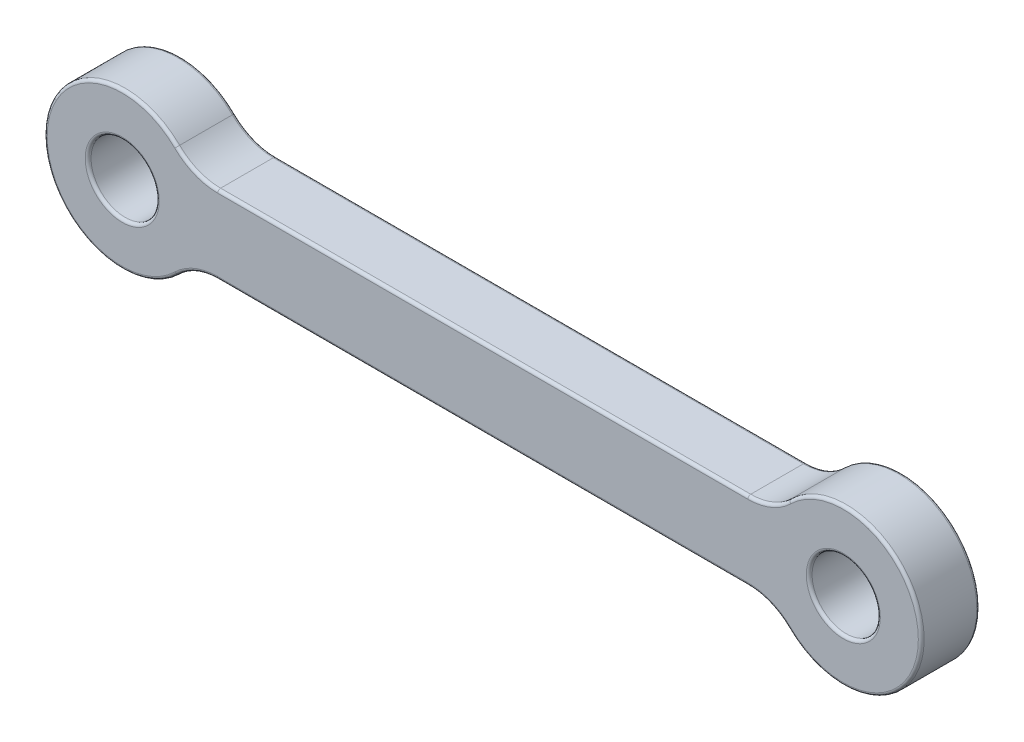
ISO-10303-21;
HEADER;
FILE_DESCRIPTION(('STEP AP214'),'2;1');
FILE_NAME('part.step','',(''),(''),'','','');
FILE_SCHEMA(('AUTOMOTIVE_DESIGN { 1 0 10303 214 1 1 1 1 }'));
ENDSEC;
DATA;
#1=APPLICATION_CONTEXT('core data for automotive mechanical design processes');
#2=APPLICATION_PROTOCOL_DEFINITION('international standard','automotive_design',2000,#1);
#3=PRODUCT_CONTEXT('',#1,'mechanical');
#4=PRODUCT('Part','Part','',(#3));
#5=PRODUCT_RELATED_PRODUCT_CATEGORY('part','',(#4));
#6=PRODUCT_DEFINITION_FORMATION('','',#4);
#7=PRODUCT_DEFINITION_CONTEXT('part definition',#1,'design');
#8=PRODUCT_DEFINITION('design','',#6,#7);
#9=PRODUCT_DEFINITION_SHAPE('','',#8);
#10=(LENGTH_UNIT() NAMED_UNIT(*) SI_UNIT(.MILLI.,.METRE.));
#11=(NAMED_UNIT(*) PLANE_ANGLE_UNIT() SI_UNIT($,.RADIAN.));
#12=(NAMED_UNIT(*) SI_UNIT($,.STERADIAN.) SOLID_ANGLE_UNIT());
#13=UNCERTAINTY_MEASURE_WITH_UNIT(LENGTH_MEASURE(1.E-05),#10,'distance_accuracy_value','');
#14=(GEOMETRIC_REPRESENTATION_CONTEXT(3) GLOBAL_UNCERTAINTY_ASSIGNED_CONTEXT((#13)) GLOBAL_UNIT_ASSIGNED_CONTEXT((#10,
#11,#12)) REPRESENTATION_CONTEXT('',''));
#15=CARTESIAN_POINT('',(0.,0.,0.));
#16=DIRECTION('',(0.,0.,1.));
#17=DIRECTION('',(1.,0.,0.));
#18=AXIS2_PLACEMENT_3D('',#15,#16,#17);
#19=CARTESIAN_POINT('',(0.,0.,1.5));
#20=DIRECTION('',(0.,0.,-1.));
#21=DIRECTION('',(-1.,0.,0.));
#22=AXIS2_PLACEMENT_3D('',#19,#20,#21);
#23=CYLINDRICAL_SURFACE('',#22,4.);
#24=DIRECTION('',(0.,0.,-1.));
#25=VECTOR('',#24,1.);
#26=CARTESIAN_POINT('',(2.79941684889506,-2.85714285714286,1.5));
#27=LINE('',#26,#25);
#28=CARTESIAN_POINT('',(2.79941684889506,-2.85714285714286,-1.35));
#29=VERTEX_POINT('',#28);
#30=CARTESIAN_POINT('',(2.79941684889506,-2.85714285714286,1.35));
#31=VERTEX_POINT('',#30);
#32=EDGE_CURVE('E266',#29,#31,#27,.F.);
#33=ORIENTED_EDGE('',*,*,#32,.T.);
#34=CARTESIAN_POINT('',(0.,0.,1.35));
#35=DIRECTION('',(0.,0.,1.));
#36=DIRECTION('',(1.,0.,0.));
#37=AXIS2_PLACEMENT_3D('',#34,#35,#36);
#38=CIRCLE('',#37,4.);
#39=CARTESIAN_POINT('',(2.79941684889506,2.85714285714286,1.35));
#40=VERTEX_POINT('',#39);
#41=EDGE_CURVE('E217',#31,#40,#38,.F.);
#42=ORIENTED_EDGE('',*,*,#41,.T.);
#43=DIRECTION('',(0.,0.,-1.));
#44=VECTOR('',#43,1.);
#45=CARTESIAN_POINT('',(2.79941684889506,2.85714285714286,1.5));
#46=LINE('',#45,#44);
#47=CARTESIAN_POINT('',(2.79941684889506,2.85714285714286,-1.35));
#48=VERTEX_POINT('',#47);
#49=EDGE_CURVE('E312',#40,#48,#46,.T.);
#50=ORIENTED_EDGE('',*,*,#49,.T.);
#51=CARTESIAN_POINT('',(0.,0.,-1.35));
#52=DIRECTION('',(0.,0.,1.));
#53=DIRECTION('',(1.,0.,0.));
#54=AXIS2_PLACEMENT_3D('',#51,#52,#53);
#55=CIRCLE('',#54,4.);
#56=EDGE_CURVE('E215',#48,#29,#55,.T.);
#57=ORIENTED_EDGE('',*,*,#56,.T.);
#58=EDGE_LOOP('',(#33,#42,#50,#57));
#59=FACE_BOUND('',#58,.T.);
#60=ADVANCED_FACE('F39',(#59),#23,.T.);
#61=CARTESIAN_POINT('',(0.,-2.,1.5));
#62=DIRECTION('',(0.,-1.,0.));
#63=DIRECTION('',(0.,0.,-1.));
#64=AXIS2_PLACEMENT_3D('',#61,#62,#63);
#65=PLANE('',#64);
#66=DIRECTION('',(0.,0.,1.));
#67=VECTOR('',#66,1.);
#68=CARTESIAN_POINT('',(32.1010205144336,-2.,1.5));
#69=LINE('',#68,#67);
#70=CARTESIAN_POINT('',(32.1010205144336,-2.,-1.35));
#71=VERTEX_POINT('',#70);
#72=CARTESIAN_POINT('',(32.1010205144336,-2.,1.35));
#73=VERTEX_POINT('',#72);
#74=EDGE_CURVE('E323',#71,#73,#69,.T.);
#75=ORIENTED_EDGE('',*,*,#74,.T.);
#76=DIRECTION('',(-1.,0.,0.));
#77=VECTOR('',#76,1.);
#78=CARTESIAN_POINT('',(0.,-2.,1.35));
#79=LINE('',#78,#77);
#80=CARTESIAN_POINT('',(4.89897948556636,-2.,1.35));
#81=VERTEX_POINT('',#80);
#82=EDGE_CURVE('E208',#73,#81,#79,.T.);
#83=ORIENTED_EDGE('',*,*,#82,.T.);
#84=DIRECTION('',(0.,0.,-1.));
#85=VECTOR('',#84,1.);
#86=CARTESIAN_POINT('',(4.89897948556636,-2.,1.5));
#87=LINE('',#86,#85);
#88=CARTESIAN_POINT('',(4.89897948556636,-2.,-1.35));
#89=VERTEX_POINT('',#88);
#90=EDGE_CURVE('E326',#81,#89,#87,.T.);
#91=ORIENTED_EDGE('',*,*,#90,.T.);
#92=DIRECTION('',(-1.,0.,0.));
#93=VECTOR('',#92,1.);
#94=CARTESIAN_POINT('',(32.1010205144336,-2.,-1.35));
#95=LINE('',#94,#93);
#96=EDGE_CURVE('E206',#89,#71,#95,.F.);
#97=ORIENTED_EDGE('',*,*,#96,.T.);
#98=EDGE_LOOP('',(#75,#83,#91,#97));
#99=FACE_BOUND('',#98,.T.);
#100=ADVANCED_FACE('F394',(#99),#65,.T.);
#101=CARTESIAN_POINT('',(37.,0.,1.5));
#102=DIRECTION('',(0.,0.,-1.));
#103=DIRECTION('',(-1.,0.,0.));
#104=AXIS2_PLACEMENT_3D('',#101,#102,#103);
#105=CYLINDRICAL_SURFACE('',#104,4.);
#106=DIRECTION('',(0.,0.,-1.));
#107=VECTOR('',#106,1.);
#108=CARTESIAN_POINT('',(34.2005831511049,2.85714285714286,1.5));
#109=LINE('',#108,#107);
#110=CARTESIAN_POINT('',(34.2005831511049,2.85714285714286,-1.35));
#111=VERTEX_POINT('',#110);
#112=CARTESIAN_POINT('',(34.2005831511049,2.85714285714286,1.35));
#113=VERTEX_POINT('',#112);
#114=EDGE_CURVE('E306',#111,#113,#109,.F.);
#115=ORIENTED_EDGE('',*,*,#114,.T.);
#116=CARTESIAN_POINT('',(37.,0.,1.35));
#117=DIRECTION('',(0.,0.,1.));
#118=DIRECTION('',(1.,0.,0.));
#119=AXIS2_PLACEMENT_3D('',#116,#117,#118);
#120=CIRCLE('',#119,4.);
#121=CARTESIAN_POINT('',(34.2005831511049,-2.85714285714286,1.35));
#122=VERTEX_POINT('',#121);
#123=EDGE_CURVE('E200',#113,#122,#120,.F.);
#124=ORIENTED_EDGE('',*,*,#123,.T.);
#125=DIRECTION('',(0.,0.,-1.));
#126=VECTOR('',#125,1.);
#127=CARTESIAN_POINT('',(34.2005831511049,-2.85714285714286,1.5));
#128=LINE('',#127,#126);
#129=CARTESIAN_POINT('',(34.2005831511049,-2.85714285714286,-1.35));
#130=VERTEX_POINT('',#129);
#131=EDGE_CURVE('E314',#122,#130,#128,.T.);
#132=ORIENTED_EDGE('',*,*,#131,.T.);
#133=CARTESIAN_POINT('',(37.,0.,-1.35));
#134=DIRECTION('',(0.,0.,1.));
#135=DIRECTION('',(1.,0.,0.));
#136=AXIS2_PLACEMENT_3D('',#133,#134,#135);
#137=CIRCLE('',#136,4.);
#138=EDGE_CURVE('E198',#130,#111,#137,.T.);
#139=ORIENTED_EDGE('',*,*,#138,.T.);
#140=EDGE_LOOP('',(#115,#124,#132,#139));
#141=FACE_BOUND('',#140,.T.);
#142=ADVANCED_FACE('F349',(#141),#105,.T.);
#143=CARTESIAN_POINT('',(0.,2.,1.5));
#144=DIRECTION('',(0.,-1.,0.));
#145=DIRECTION('',(0.,0.,-1.));
#146=AXIS2_PLACEMENT_3D('',#143,#144,#145);
#147=PLANE('',#146);
#148=DIRECTION('',(0.,0.,1.));
#149=VECTOR('',#148,1.);
#150=CARTESIAN_POINT('',(4.89897948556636,2.,1.5));
#151=LINE('',#150,#149);
#152=CARTESIAN_POINT('',(4.89897948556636,2.,-1.35));
#153=VERTEX_POINT('',#152);
#154=CARTESIAN_POINT('',(4.89897948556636,2.,1.35));
#155=VERTEX_POINT('',#154);
#156=EDGE_CURVE('E311',#153,#155,#151,.T.);
#157=ORIENTED_EDGE('',*,*,#156,.T.);
#158=DIRECTION('',(-1.,0.,0.));
#159=VECTOR('',#158,1.);
#160=CARTESIAN_POINT('',(32.1010205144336,2.,1.35));
#161=LINE('',#160,#159);
#162=CARTESIAN_POINT('',(32.1010205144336,2.,1.35));
#163=VERTEX_POINT('',#162);
#164=EDGE_CURVE('E225',#155,#163,#161,.F.);
#165=ORIENTED_EDGE('',*,*,#164,.T.);
#166=DIRECTION('',(0.,0.,-1.));
#167=VECTOR('',#166,1.);
#168=CARTESIAN_POINT('',(32.1010205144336,2.,1.5));
#169=LINE('',#168,#167);
#170=CARTESIAN_POINT('',(32.1010205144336,2.,-1.35));
#171=VERTEX_POINT('',#170);
#172=EDGE_CURVE('E304',#163,#171,#169,.T.);
#173=ORIENTED_EDGE('',*,*,#172,.T.);
#174=DIRECTION('',(-1.,0.,0.));
#175=VECTOR('',#174,1.);
#176=CARTESIAN_POINT('',(0.,2.,-1.35));
#177=LINE('',#176,#175);
#178=EDGE_CURVE('E223',#171,#153,#177,.T.);
#179=ORIENTED_EDGE('',*,*,#178,.T.);
#180=EDGE_LOOP('',(#157,#165,#173,#179));
#181=FACE_BOUND('',#180,.T.);
#182=ADVANCED_FACE('F309',(#181),#147,.F.);
#183=CARTESIAN_POINT('',(0.,0.,1.5));
#184=DIRECTION('',(0.,0.,-1.));
#185=DIRECTION('',(-1.,0.,0.));
#186=AXIS2_PLACEMENT_3D('',#183,#184,#185);
#187=CYLINDRICAL_SURFACE('',#186,1.75);
#188=CARTESIAN_POINT('',(0.,0.,1.35));
#189=DIRECTION('',(0.,0.,1.));
#190=DIRECTION('',(1.,0.,0.));
#191=AXIS2_PLACEMENT_3D('',#188,#189,#190);
#192=CIRCLE('',#191,1.75);
#193=CARTESIAN_POINT('',(1.75,0.,1.35));
#194=VERTEX_POINT('',#193);
#195=EDGE_CURVE('E230',#194,#194,#192,.T.);
#196=ORIENTED_EDGE('',*,*,#195,.T.);
#197=EDGE_LOOP('',(#196));
#198=FACE_BOUND('',#197,.T.);
#199=CARTESIAN_POINT('',(0.,0.,-1.35));
#200=DIRECTION('',(0.,0.,1.));
#201=DIRECTION('',(1.,0.,0.));
#202=AXIS2_PLACEMENT_3D('',#199,#200,#201);
#203=CIRCLE('',#202,1.75);
#204=CARTESIAN_POINT('',(1.75,0.,-1.35));
#205=VERTEX_POINT('',#204);
#206=EDGE_CURVE('E227',#205,#205,#203,.F.);
#207=ORIENTED_EDGE('',*,*,#206,.T.);
#208=EDGE_LOOP('',(#207));
#209=FACE_BOUND('',#208,.T.);
#210=ADVANCED_FACE('F405',(#198,#209),#187,.F.);
#211=CARTESIAN_POINT('',(37.,0.,1.5));
#212=DIRECTION('',(0.,0.,-1.));
#213=DIRECTION('',(-1.,0.,0.));
#214=AXIS2_PLACEMENT_3D('',#211,#212,#213);
#215=CYLINDRICAL_SURFACE('',#214,1.75);
#216=CARTESIAN_POINT('',(37.,0.,1.35));
#217=DIRECTION('',(0.,0.,1.));
#218=DIRECTION('',(1.,0.,0.));
#219=AXIS2_PLACEMENT_3D('',#216,#217,#218);
#220=CIRCLE('',#219,1.75);
#221=CARTESIAN_POINT('',(38.75,0.,1.35));
#222=VERTEX_POINT('',#221);
#223=EDGE_CURVE('E192',#222,#222,#220,.T.);
#224=ORIENTED_EDGE('',*,*,#223,.T.);
#225=EDGE_LOOP('',(#224));
#226=FACE_BOUND('',#225,.T.);
#227=CARTESIAN_POINT('',(37.,0.,-1.35));
#228=DIRECTION('',(0.,0.,1.));
#229=DIRECTION('',(1.,0.,0.));
#230=AXIS2_PLACEMENT_3D('',#227,#228,#229);
#231=CIRCLE('',#230,1.75);
#232=CARTESIAN_POINT('',(38.75,0.,-1.35));
#233=VERTEX_POINT('',#232);
#234=EDGE_CURVE('E184',#233,#233,#231,.F.);
#235=ORIENTED_EDGE('',*,*,#234,.T.);
#236=EDGE_LOOP('',(#235));
#237=FACE_BOUND('',#236,.T.);
#238=ADVANCED_FACE('F408',(#226,#237),#215,.F.);
#239=CARTESIAN_POINT('',(0.,0.,1.5));
#240=DIRECTION('',(0.,0.,1.));
#241=DIRECTION('',(1.,0.,0.));
#242=AXIS2_PLACEMENT_3D('',#239,#240,#241);
#243=PLANE('',#242);
#244=CARTESIAN_POINT('',(37.,0.,1.5));
#245=DIRECTION('',(0.,0.,1.));
#246=DIRECTION('',(1.,0.,0.));
#247=AXIS2_PLACEMENT_3D('',#244,#245,#246);
#248=CIRCLE('',#247,1.9);
#249=CARTESIAN_POINT('',(38.9,0.,1.5));
#250=VERTEX_POINT('',#249);
#251=EDGE_CURVE('E181',#250,#250,#248,.F.);
#252=ORIENTED_EDGE('',*,*,#251,.T.);
#253=EDGE_LOOP('',(#252));
#254=FACE_BOUND('',#253,.T.);
#255=CARTESIAN_POINT('',(37.,0.,1.5));
#256=DIRECTION('',(0.,0.,1.));
#257=DIRECTION('',(1.,0.,0.));
#258=AXIS2_PLACEMENT_3D('',#255,#256,#257);
#259=CIRCLE('',#258,3.85);
#260=CARTESIAN_POINT('',(34.3055612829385,-2.75,1.5));
#261=VERTEX_POINT('',#260);
#262=CARTESIAN_POINT('',(34.3055612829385,2.75,1.5));
#263=VERTEX_POINT('',#262);
#264=EDGE_CURVE('E179',#261,#263,#259,.T.);
#265=ORIENTED_EDGE('',*,*,#264,.T.);
#266=CARTESIAN_POINT('',(32.1010205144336,5.,1.5));
#267=DIRECTION('',(0.,0.,1.));
#268=DIRECTION('',(1.,0.,0.));
#269=AXIS2_PLACEMENT_3D('',#266,#267,#268);
#270=CIRCLE('',#269,3.15);
#271=CARTESIAN_POINT('',(32.1010205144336,1.85,1.5));
#272=VERTEX_POINT('',#271);
#273=EDGE_CURVE('E159',#263,#272,#270,.F.);
#274=ORIENTED_EDGE('',*,*,#273,.T.);
#275=DIRECTION('',(-1.,0.,0.));
#276=VECTOR('',#275,1.);
#277=CARTESIAN_POINT('',(4.89897948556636,1.85,1.5));
#278=LINE('',#277,#276);
#279=CARTESIAN_POINT('',(4.89897948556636,1.85,1.5));
#280=VERTEX_POINT('',#279);
#281=EDGE_CURVE('E167',#272,#280,#278,.T.);
#282=ORIENTED_EDGE('',*,*,#281,.T.);
#283=CARTESIAN_POINT('',(4.89897948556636,5.,1.5));
#284=DIRECTION('',(0.,0.,1.));
#285=DIRECTION('',(1.,0.,0.));
#286=AXIS2_PLACEMENT_3D('',#283,#284,#285);
#287=CIRCLE('',#286,3.15);
#288=CARTESIAN_POINT('',(2.6944387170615,2.75,1.5));
#289=VERTEX_POINT('',#288);
#290=EDGE_CURVE('E173',#280,#289,#287,.F.);
#291=ORIENTED_EDGE('',*,*,#290,.T.);
#292=CARTESIAN_POINT('',(0.,0.,1.5));
#293=DIRECTION('',(0.,0.,1.));
#294=DIRECTION('',(1.,0.,0.));
#295=AXIS2_PLACEMENT_3D('',#292,#293,#294);
#296=CIRCLE('',#295,3.85);
#297=CARTESIAN_POINT('',(2.6944387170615,-2.75,1.5));
#298=VERTEX_POINT('',#297);
#299=EDGE_CURVE('E332',#289,#298,#296,.T.);
#300=ORIENTED_EDGE('',*,*,#299,.T.);
#301=CARTESIAN_POINT('',(4.89897948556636,-5.,1.5));
#302=DIRECTION('',(0.,0.,1.));
#303=DIRECTION('',(1.,0.,0.));
#304=AXIS2_PLACEMENT_3D('',#301,#302,#303);
#305=CIRCLE('',#304,3.15);
#306=CARTESIAN_POINT('',(4.89897948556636,-1.85,1.5));
#307=VERTEX_POINT('',#306);
#308=EDGE_CURVE('E334',#298,#307,#305,.F.);
#309=ORIENTED_EDGE('',*,*,#308,.T.);
#310=DIRECTION('',(-1.,0.,0.));
#311=VECTOR('',#310,1.);
#312=CARTESIAN_POINT('',(0.,-1.85,1.5));
#313=LINE('',#312,#311);
#314=CARTESIAN_POINT('',(32.1010205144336,-1.85,1.5));
#315=VERTEX_POINT('',#314);
#316=EDGE_CURVE('E336',#307,#315,#313,.F.);
#317=ORIENTED_EDGE('',*,*,#316,.T.);
#318=CARTESIAN_POINT('',(32.1010205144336,-5.,1.5));
#319=DIRECTION('',(0.,0.,1.));
#320=DIRECTION('',(1.,0.,0.));
#321=AXIS2_PLACEMENT_3D('',#318,#319,#320);
#322=CIRCLE('',#321,3.15);
#323=EDGE_CURVE('E186',#315,#261,#322,.F.);
#324=ORIENTED_EDGE('',*,*,#323,.T.);
#325=EDGE_LOOP('',(#265,#274,#282,#291,#300,#309,#317,#324));
#326=FACE_BOUND('',#325,.T.);
#327=CARTESIAN_POINT('',(0.,0.,1.5));
#328=DIRECTION('',(0.,0.,1.));
#329=DIRECTION('',(1.,0.,0.));
#330=AXIS2_PLACEMENT_3D('',#327,#328,#329);
#331=CIRCLE('',#330,1.9);
#332=CARTESIAN_POINT('',(1.9,0.,1.5));
#333=VERTEX_POINT('',#332);
#334=EDGE_CURVE('E174',#333,#333,#331,.F.);
#335=ORIENTED_EDGE('',*,*,#334,.T.);
#336=EDGE_LOOP('',(#335));
#337=FACE_BOUND('',#336,.T.);
#338=ADVANCED_FACE('F176',(#254,#326,#337),#243,.T.);
#339=CARTESIAN_POINT('',(0.,0.,-1.5));
#340=DIRECTION('',(0.,0.,1.));
#341=DIRECTION('',(1.,0.,0.));
#342=AXIS2_PLACEMENT_3D('',#339,#340,#341);
#343=PLANE('',#342);
#344=CARTESIAN_POINT('',(37.,0.,-1.5));
#345=DIRECTION('',(0.,0.,1.));
#346=DIRECTION('',(1.,0.,0.));
#347=AXIS2_PLACEMENT_3D('',#344,#345,#346);
#348=CIRCLE('',#347,1.9);
#349=CARTESIAN_POINT('',(38.9,0.,-1.5));
#350=VERTEX_POINT('',#349);
#351=EDGE_CURVE('E11',#350,#350,#348,.T.);
#352=ORIENTED_EDGE('',*,*,#351,.T.);
#353=EDGE_LOOP('',(#352));
#354=FACE_BOUND('',#353,.T.);
#355=DIRECTION('',(-1.,0.,0.));
#356=VECTOR('',#355,1.);
#357=CARTESIAN_POINT('',(4.89897948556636,-1.85,-1.5));
#358=LINE('',#357,#356);
#359=CARTESIAN_POINT('',(32.1010205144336,-1.85,-1.5));
#360=VERTEX_POINT('',#359);
#361=CARTESIAN_POINT('',(4.89897948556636,-1.85,-1.5));
#362=VERTEX_POINT('',#361);
#363=EDGE_CURVE('E56',#360,#362,#358,.T.);
#364=ORIENTED_EDGE('',*,*,#363,.T.);
#365=CARTESIAN_POINT('',(4.89897948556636,-5.,-1.5));
#366=DIRECTION('',(0.,0.,1.));
#367=DIRECTION('',(1.,0.,0.));
#368=AXIS2_PLACEMENT_3D('',#365,#366,#367);
#369=CIRCLE('',#368,3.15);
#370=CARTESIAN_POINT('',(2.6944387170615,-2.75,-1.5));
#371=VERTEX_POINT('',#370);
#372=EDGE_CURVE('E48',#362,#371,#369,.T.);
#373=ORIENTED_EDGE('',*,*,#372,.T.);
#374=CARTESIAN_POINT('',(0.,0.,-1.5));
#375=DIRECTION('',(0.,0.,1.));
#376=DIRECTION('',(1.,0.,0.));
#377=AXIS2_PLACEMENT_3D('',#374,#375,#376);
#378=CIRCLE('',#377,3.85);
#379=CARTESIAN_POINT('',(2.6944387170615,2.75,-1.5));
#380=VERTEX_POINT('',#379);
#381=EDGE_CURVE('E236',#371,#380,#378,.F.);
#382=ORIENTED_EDGE('',*,*,#381,.T.);
#383=CARTESIAN_POINT('',(4.89897948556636,5.,-1.5));
#384=DIRECTION('',(0.,0.,1.));
#385=DIRECTION('',(1.,0.,0.));
#386=AXIS2_PLACEMENT_3D('',#383,#384,#385);
#387=CIRCLE('',#386,3.15);
#388=CARTESIAN_POINT('',(4.89897948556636,1.85,-1.5));
#389=VERTEX_POINT('',#388);
#390=EDGE_CURVE('E238',#380,#389,#387,.T.);
#391=ORIENTED_EDGE('',*,*,#390,.T.);
#392=DIRECTION('',(-1.,0.,0.));
#393=VECTOR('',#392,1.);
#394=CARTESIAN_POINT('',(0.,1.85,-1.5));
#395=LINE('',#394,#393);
#396=CARTESIAN_POINT('',(32.1010205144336,1.85,-1.5));
#397=VERTEX_POINT('',#396);
#398=EDGE_CURVE('E240',#389,#397,#395,.F.);
#399=ORIENTED_EDGE('',*,*,#398,.T.);
#400=CARTESIAN_POINT('',(32.1010205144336,5.,-1.5));
#401=DIRECTION('',(0.,0.,1.));
#402=DIRECTION('',(1.,0.,0.));
#403=AXIS2_PLACEMENT_3D('',#400,#401,#402);
#404=CIRCLE('',#403,3.15);
#405=CARTESIAN_POINT('',(34.3055612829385,2.75,-1.5));
#406=VERTEX_POINT('',#405);
#407=EDGE_CURVE('E242',#397,#406,#404,.T.);
#408=ORIENTED_EDGE('',*,*,#407,.T.);
#409=CARTESIAN_POINT('',(37.,0.,-1.5));
#410=DIRECTION('',(0.,0.,1.));
#411=DIRECTION('',(1.,0.,0.));
#412=AXIS2_PLACEMENT_3D('',#409,#410,#411);
#413=CIRCLE('',#412,3.85);
#414=CARTESIAN_POINT('',(34.3055612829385,-2.75,-1.5));
#415=VERTEX_POINT('',#414);
#416=EDGE_CURVE('E244',#406,#415,#413,.F.);
#417=ORIENTED_EDGE('',*,*,#416,.T.);
#418=CARTESIAN_POINT('',(32.1010205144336,-5.,-1.5));
#419=DIRECTION('',(0.,0.,1.));
#420=DIRECTION('',(1.,0.,0.));
#421=AXIS2_PLACEMENT_3D('',#418,#419,#420);
#422=CIRCLE('',#421,3.15);
#423=EDGE_CURVE('E61',#415,#360,#422,.T.);
#424=ORIENTED_EDGE('',*,*,#423,.T.);
#425=EDGE_LOOP('',(#364,#373,#382,#391,#399,#408,#417,#424));
#426=FACE_BOUND('',#425,.T.);
#427=CARTESIAN_POINT('',(0.,0.,-1.5));
#428=DIRECTION('',(0.,0.,1.));
#429=DIRECTION('',(1.,0.,0.));
#430=AXIS2_PLACEMENT_3D('',#427,#428,#429);
#431=CIRCLE('',#430,1.9);
#432=CARTESIAN_POINT('',(1.9,0.,-1.5));
#433=VERTEX_POINT('',#432);
#434=EDGE_CURVE('E233',#433,#433,#431,.T.);
#435=ORIENTED_EDGE('',*,*,#434,.T.);
#436=EDGE_LOOP('',(#435));
#437=FACE_BOUND('',#436,.T.);
#438=ADVANCED_FACE('F365',(#354,#426,#437),#343,.F.);
#439=CARTESIAN_POINT('',(4.89897948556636,5.,1.5));
#440=DIRECTION('',(0.,0.,-1.));
#441=DIRECTION('',(-1.,0.,0.));
#442=AXIS2_PLACEMENT_3D('',#439,#440,#441);
#443=CYLINDRICAL_SURFACE('',#442,3.);
#444=ORIENTED_EDGE('',*,*,#49,.F.);
#445=CARTESIAN_POINT('',(4.89897948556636,5.,1.35));
#446=DIRECTION('',(0.,0.,1.));
#447=DIRECTION('',(1.,0.,0.));
#448=AXIS2_PLACEMENT_3D('',#445,#446,#447);
#449=CIRCLE('',#448,3.);
#450=EDGE_CURVE('E221',#40,#155,#449,.T.);
#451=ORIENTED_EDGE('',*,*,#450,.T.);
#452=ORIENTED_EDGE('',*,*,#156,.F.);
#453=CARTESIAN_POINT('',(4.89897948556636,5.,-1.35));
#454=DIRECTION('',(0.,0.,1.));
#455=DIRECTION('',(1.,0.,0.));
#456=AXIS2_PLACEMENT_3D('',#453,#454,#455);
#457=CIRCLE('',#456,3.);
#458=EDGE_CURVE('E219',#153,#48,#457,.F.);
#459=ORIENTED_EDGE('',*,*,#458,.T.);
#460=EDGE_LOOP('',(#444,#451,#452,#459));
#461=FACE_BOUND('',#460,.T.);
#462=ADVANCED_FACE('F410',(#461),#443,.F.);
#463=CARTESIAN_POINT('',(32.1010205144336,5.,1.5));
#464=DIRECTION('',(0.,0.,-1.));
#465=DIRECTION('',(-1.,0.,0.));
#466=AXIS2_PLACEMENT_3D('',#463,#464,#465);
#467=CYLINDRICAL_SURFACE('',#466,3.);
#468=ORIENTED_EDGE('',*,*,#172,.F.);
#469=CARTESIAN_POINT('',(32.1010205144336,5.,1.35));
#470=DIRECTION('',(0.,0.,1.));
#471=DIRECTION('',(1.,0.,0.));
#472=AXIS2_PLACEMENT_3D('',#469,#470,#471);
#473=CIRCLE('',#472,3.);
#474=EDGE_CURVE('E161',#163,#113,#473,.T.);
#475=ORIENTED_EDGE('',*,*,#474,.T.);
#476=ORIENTED_EDGE('',*,*,#114,.F.);
#477=CARTESIAN_POINT('',(32.1010205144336,5.,-1.35));
#478=DIRECTION('',(0.,0.,1.));
#479=DIRECTION('',(1.,0.,0.));
#480=AXIS2_PLACEMENT_3D('',#477,#478,#479);
#481=CIRCLE('',#480,3.);
#482=EDGE_CURVE('E195',#111,#171,#481,.F.);
#483=ORIENTED_EDGE('',*,*,#482,.T.);
#484=EDGE_LOOP('',(#468,#475,#476,#483));
#485=FACE_BOUND('',#484,.T.);
#486=ADVANCED_FACE('F303',(#485),#467,.F.);
#487=CARTESIAN_POINT('',(4.89897948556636,-5.,1.5));
#488=DIRECTION('',(0.,0.,-1.));
#489=DIRECTION('',(-1.,0.,0.));
#490=AXIS2_PLACEMENT_3D('',#487,#488,#489);
#491=CYLINDRICAL_SURFACE('',#490,3.);
#492=ORIENTED_EDGE('',*,*,#90,.F.);
#493=CARTESIAN_POINT('',(4.89897948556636,-5.,1.35));
#494=DIRECTION('',(0.,0.,1.));
#495=DIRECTION('',(1.,0.,0.));
#496=AXIS2_PLACEMENT_3D('',#493,#494,#495);
#497=CIRCLE('',#496,3.);
#498=EDGE_CURVE('E213',#81,#31,#497,.T.);
#499=ORIENTED_EDGE('',*,*,#498,.T.);
#500=ORIENTED_EDGE('',*,*,#32,.F.);
#501=CARTESIAN_POINT('',(4.89897948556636,-5.,-1.35));
#502=DIRECTION('',(0.,0.,1.));
#503=DIRECTION('',(1.,0.,0.));
#504=AXIS2_PLACEMENT_3D('',#501,#502,#503);
#505=CIRCLE('',#504,3.);
#506=EDGE_CURVE('E210',#29,#89,#505,.F.);
#507=ORIENTED_EDGE('',*,*,#506,.T.);
#508=EDGE_LOOP('',(#492,#499,#500,#507));
#509=FACE_BOUND('',#508,.T.);
#510=ADVANCED_FACE('F383',(#509),#491,.F.);
#511=CARTESIAN_POINT('',(32.1010205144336,-5.,1.5));
#512=DIRECTION('',(0.,0.,-1.));
#513=DIRECTION('',(-1.,0.,0.));
#514=AXIS2_PLACEMENT_3D('',#511,#512,#513);
#515=CYLINDRICAL_SURFACE('',#514,3.);
#516=ORIENTED_EDGE('',*,*,#131,.F.);
#517=CARTESIAN_POINT('',(32.1010205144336,-5.,1.35));
#518=DIRECTION('',(0.,0.,1.));
#519=DIRECTION('',(1.,0.,0.));
#520=AXIS2_PLACEMENT_3D('',#517,#518,#519);
#521=CIRCLE('',#520,3.);
#522=EDGE_CURVE('E204',#122,#73,#521,.T.);
#523=ORIENTED_EDGE('',*,*,#522,.T.);
#524=ORIENTED_EDGE('',*,*,#74,.F.);
#525=CARTESIAN_POINT('',(32.1010205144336,-5.,-1.35));
#526=DIRECTION('',(0.,0.,1.));
#527=DIRECTION('',(1.,0.,0.));
#528=AXIS2_PLACEMENT_3D('',#525,#526,#527);
#529=CIRCLE('',#528,3.);
#530=EDGE_CURVE('E202',#71,#130,#529,.F.);
#531=ORIENTED_EDGE('',*,*,#530,.T.);
#532=EDGE_LOOP('',(#516,#523,#524,#531));
#533=FACE_BOUND('',#532,.T.);
#534=ADVANCED_FACE('F351',(#533),#515,.F.);
#535=CARTESIAN_POINT('',(37.,0.,1.35));
#536=DIRECTION('',(0.,0.,1.));
#537=DIRECTION('',(1.,0.,0.));
#538=AXIS2_PLACEMENT_3D('',#535,#536,#537);
#539=TOROIDAL_SURFACE('',#538,1.9,0.15);
#540=ORIENTED_EDGE('',*,*,#223,.F.);
#541=EDGE_LOOP('',(#540));
#542=FACE_BOUND('',#541,.T.);
#543=ORIENTED_EDGE('',*,*,#251,.F.);
#544=EDGE_LOOP('',(#543));
#545=FACE_BOUND('',#544,.T.);
#546=ADVANCED_FACE('F420',(#542,#545),#539,.T.);
#547=CARTESIAN_POINT('',(4.89897948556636,-5.,1.35));
#548=DIRECTION('',(0.,0.,1.));
#549=DIRECTION('',(1.,0.,0.));
#550=AXIS2_PLACEMENT_3D('',#547,#548,#549);
#551=TOROIDAL_SURFACE('',#550,3.15,0.15);
#552=CARTESIAN_POINT('',(2.6944387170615,-2.75,1.35));
#553=DIRECTION('',(-0.714285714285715,-0.699854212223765,0.));
#554=DIRECTION('',(0.699854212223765,-0.714285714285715,0.));
#555=AXIS2_PLACEMENT_3D('',#552,#553,#554);
#556=CIRCLE('',#555,0.15);
#557=EDGE_CURVE('E260',#31,#298,#556,.T.);
#558=ORIENTED_EDGE('',*,*,#557,.F.);
#559=ORIENTED_EDGE('',*,*,#498,.F.);
#560=CARTESIAN_POINT('',(4.89897948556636,-1.85,1.35));
#561=DIRECTION('',(1.,0.,0.));
#562=DIRECTION('',(0.,0.,-1.));
#563=AXIS2_PLACEMENT_3D('',#560,#561,#562);
#564=CIRCLE('',#563,0.15);
#565=EDGE_CURVE('E263',#307,#81,#564,.T.);
#566=ORIENTED_EDGE('',*,*,#565,.F.);
#567=ORIENTED_EDGE('',*,*,#308,.F.);
#568=EDGE_LOOP('',(#558,#559,#566,#567));
#569=FACE_BOUND('',#568,.T.);
#570=ADVANCED_FACE('F387',(#569),#551,.T.);
#571=CARTESIAN_POINT('',(0.,-1.85,1.35));
#572=DIRECTION('',(-1.,0.,0.));
#573=DIRECTION('',(0.,0.,1.));
#574=AXIS2_PLACEMENT_3D('',#571,#572,#573);
#575=CYLINDRICAL_SURFACE('',#574,0.15);
#576=ORIENTED_EDGE('',*,*,#565,.T.);
#577=ORIENTED_EDGE('',*,*,#82,.F.);
#578=CARTESIAN_POINT('',(32.1010205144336,-1.85,1.35));
#579=DIRECTION('',(1.,0.,0.));
#580=DIRECTION('',(0.,0.,-1.));
#581=AXIS2_PLACEMENT_3D('',#578,#579,#580);
#582=CIRCLE('',#581,0.15);
#583=EDGE_CURVE('E257',#315,#73,#582,.T.);
#584=ORIENTED_EDGE('',*,*,#583,.F.);
#585=ORIENTED_EDGE('',*,*,#316,.F.);
#586=EDGE_LOOP('',(#576,#577,#584,#585));
#587=FACE_BOUND('',#586,.T.);
#588=ADVANCED_FACE('F392',(#587),#575,.T.);
#589=CARTESIAN_POINT('',(0.,0.,1.35));
#590=DIRECTION('',(0.,0.,1.));
#591=DIRECTION('',(1.,0.,0.));
#592=AXIS2_PLACEMENT_3D('',#589,#590,#591);
#593=TOROIDAL_SURFACE('',#592,3.85,0.15);
#594=ORIENTED_EDGE('',*,*,#557,.T.);
#595=ORIENTED_EDGE('',*,*,#299,.F.);
#596=CARTESIAN_POINT('',(2.6944387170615,2.75,1.35));
#597=DIRECTION('',(0.714285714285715,-0.699854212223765,0.));
#598=DIRECTION('',(0.699854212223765,0.714285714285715,0.));
#599=AXIS2_PLACEMENT_3D('',#596,#597,#598);
#600=CIRCLE('',#599,0.15);
#601=EDGE_CURVE('E254',#40,#289,#600,.T.);
#602=ORIENTED_EDGE('',*,*,#601,.F.);
#603=ORIENTED_EDGE('',*,*,#41,.F.);
#604=EDGE_LOOP('',(#594,#595,#602,#603));
#605=FACE_BOUND('',#604,.T.);
#606=ADVANCED_FACE('F437',(#605),#593,.T.);
#607=CARTESIAN_POINT('',(32.1010205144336,-5.,1.35));
#608=DIRECTION('',(0.,0.,1.));
#609=DIRECTION('',(1.,0.,0.));
#610=AXIS2_PLACEMENT_3D('',#607,#608,#609);
#611=TOROIDAL_SURFACE('',#610,3.15,0.15);
#612=ORIENTED_EDGE('',*,*,#583,.T.);
#613=ORIENTED_EDGE('',*,*,#522,.F.);
#614=CARTESIAN_POINT('',(34.3055612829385,-2.75,1.35));
#615=DIRECTION('',(0.714285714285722,-0.699854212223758,0.));
#616=DIRECTION('',(0.699854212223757,0.714285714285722,0.));
#617=AXIS2_PLACEMENT_3D('',#614,#615,#616);
#618=CIRCLE('',#617,0.15);
#619=EDGE_CURVE('E251',#261,#122,#618,.T.);
#620=ORIENTED_EDGE('',*,*,#619,.F.);
#621=ORIENTED_EDGE('',*,*,#323,.F.);
#622=EDGE_LOOP('',(#612,#613,#620,#621));
#623=FACE_BOUND('',#622,.T.);
#624=ADVANCED_FACE('F343',(#623),#611,.T.);
#625=CARTESIAN_POINT('',(4.89897948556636,5.,1.35));
#626=DIRECTION('',(0.,0.,1.));
#627=DIRECTION('',(1.,0.,0.));
#628=AXIS2_PLACEMENT_3D('',#625,#626,#627);
#629=TOROIDAL_SURFACE('',#628,3.15,0.15);
#630=ORIENTED_EDGE('',*,*,#601,.T.);
#631=ORIENTED_EDGE('',*,*,#290,.F.);
#632=CARTESIAN_POINT('',(4.89897948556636,1.85,1.35));
#633=DIRECTION('',(1.,0.,0.));
#634=DIRECTION('',(0.,0.,-1.));
#635=AXIS2_PLACEMENT_3D('',#632,#633,#634);
#636=CIRCLE('',#635,0.15);
#637=EDGE_CURVE('E170',#155,#280,#636,.T.);
#638=ORIENTED_EDGE('',*,*,#637,.F.);
#639=ORIENTED_EDGE('',*,*,#450,.F.);
#640=EDGE_LOOP('',(#630,#631,#638,#639));
#641=FACE_BOUND('',#640,.T.);
#642=ADVANCED_FACE('F431',(#641),#629,.T.);
#643=CARTESIAN_POINT('',(37.,0.,1.35));
#644=DIRECTION('',(0.,0.,1.));
#645=DIRECTION('',(1.,0.,0.));
#646=AXIS2_PLACEMENT_3D('',#643,#644,#645);
#647=TOROIDAL_SURFACE('',#646,3.85,0.15);
#648=ORIENTED_EDGE('',*,*,#619,.T.);
#649=ORIENTED_EDGE('',*,*,#123,.F.);
#650=CARTESIAN_POINT('',(34.3055612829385,2.75,1.35));
#651=DIRECTION('',(-0.714285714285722,-0.699854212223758,0.));
#652=DIRECTION('',(0.699854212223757,-0.714285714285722,0.));
#653=AXIS2_PLACEMENT_3D('',#650,#651,#652);
#654=CIRCLE('',#653,0.15);
#655=EDGE_CURVE('E164',#263,#113,#654,.T.);
#656=ORIENTED_EDGE('',*,*,#655,.F.);
#657=ORIENTED_EDGE('',*,*,#264,.F.);
#658=EDGE_LOOP('',(#648,#649,#656,#657));
#659=FACE_BOUND('',#658,.T.);
#660=ADVANCED_FACE('F346',(#659),#647,.T.);
#661=CARTESIAN_POINT('',(0.,1.85,1.35));
#662=DIRECTION('',(1.,0.,0.));
#663=DIRECTION('',(0.,0.,-1.));
#664=AXIS2_PLACEMENT_3D('',#661,#662,#663);
#665=CYLINDRICAL_SURFACE('',#664,0.15);
#666=ORIENTED_EDGE('',*,*,#637,.T.);
#667=ORIENTED_EDGE('',*,*,#281,.F.);
#668=CARTESIAN_POINT('',(32.1010205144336,1.85,1.35));
#669=DIRECTION('',(1.,0.,0.));
#670=DIRECTION('',(0.,0.,-1.));
#671=AXIS2_PLACEMENT_3D('',#668,#669,#670);
#672=CIRCLE('',#671,0.15);
#673=EDGE_CURVE('E155',#163,#272,#672,.T.);
#674=ORIENTED_EDGE('',*,*,#673,.F.);
#675=ORIENTED_EDGE('',*,*,#164,.F.);
#676=EDGE_LOOP('',(#666,#667,#674,#675));
#677=FACE_BOUND('',#676,.T.);
#678=ADVANCED_FACE('F168',(#677),#665,.T.);
#679=CARTESIAN_POINT('',(32.1010205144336,5.,1.35));
#680=DIRECTION('',(0.,0.,1.));
#681=DIRECTION('',(1.,0.,0.));
#682=AXIS2_PLACEMENT_3D('',#679,#680,#681);
#683=TOROIDAL_SURFACE('',#682,3.15,0.15);
#684=ORIENTED_EDGE('',*,*,#655,.T.);
#685=ORIENTED_EDGE('',*,*,#474,.F.);
#686=ORIENTED_EDGE('',*,*,#673,.T.);
#687=ORIENTED_EDGE('',*,*,#273,.F.);
#688=EDGE_LOOP('',(#684,#685,#686,#687));
#689=FACE_BOUND('',#688,.T.);
#690=ADVANCED_FACE('F157',(#689),#683,.T.);
#691=CARTESIAN_POINT('',(0.,0.,1.35));
#692=DIRECTION('',(0.,0.,1.));
#693=DIRECTION('',(1.,0.,0.));
#694=AXIS2_PLACEMENT_3D('',#691,#692,#693);
#695=TOROIDAL_SURFACE('',#694,1.9,0.15);
#696=ORIENTED_EDGE('',*,*,#334,.F.);
#697=EDGE_LOOP('',(#696));
#698=FACE_BOUND('',#697,.T.);
#699=ORIENTED_EDGE('',*,*,#195,.F.);
#700=EDGE_LOOP('',(#699));
#701=FACE_BOUND('',#700,.T.);
#702=ADVANCED_FACE('F426',(#698,#701),#695,.T.);
#703=CARTESIAN_POINT('',(37.,0.,-1.35));
#704=DIRECTION('',(0.,0.,1.));
#705=DIRECTION('',(1.,0.,0.));
#706=AXIS2_PLACEMENT_3D('',#703,#704,#705);
#707=TOROIDAL_SURFACE('',#706,1.9,0.15);
#708=ORIENTED_EDGE('',*,*,#351,.F.);
#709=EDGE_LOOP('',(#708));
#710=FACE_BOUND('',#709,.T.);
#711=ORIENTED_EDGE('',*,*,#234,.F.);
#712=EDGE_LOOP('',(#711));
#713=FACE_BOUND('',#712,.T.);
#714=ADVANCED_FACE('F447',(#710,#713),#707,.T.);
#715=CARTESIAN_POINT('',(32.1010205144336,5.,-1.35));
#716=DIRECTION('',(0.,0.,1.));
#717=DIRECTION('',(1.,0.,0.));
#718=AXIS2_PLACEMENT_3D('',#715,#716,#717);
#719=TOROIDAL_SURFACE('',#718,3.15,0.15);
#720=CARTESIAN_POINT('',(32.1010205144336,1.85,-1.35));
#721=DIRECTION('',(-1.,0.,0.));
#722=DIRECTION('',(0.,0.,1.));
#723=AXIS2_PLACEMENT_3D('',#720,#721,#722);
#724=CIRCLE('',#723,0.15);
#725=EDGE_CURVE('E282',#171,#397,#724,.T.);
#726=ORIENTED_EDGE('',*,*,#725,.F.);
#727=ORIENTED_EDGE('',*,*,#482,.F.);
#728=CARTESIAN_POINT('',(34.3055612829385,2.75,-1.35));
#729=DIRECTION('',(0.714285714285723,0.699854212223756,0.));
#730=DIRECTION('',(-0.699854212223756,0.714285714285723,0.));
#731=AXIS2_PLACEMENT_3D('',#728,#729,#730);
#732=CIRCLE('',#731,0.15);
#733=EDGE_CURVE('E43',#406,#111,#732,.T.);
#734=ORIENTED_EDGE('',*,*,#733,.F.);
#735=ORIENTED_EDGE('',*,*,#407,.F.);
#736=EDGE_LOOP('',(#726,#727,#734,#735));
#737=FACE_BOUND('',#736,.T.);
#738=ADVANCED_FACE('F298',(#737),#719,.T.);
#739=CARTESIAN_POINT('',(37.,0.,-1.35));
#740=DIRECTION('',(0.,0.,1.));
#741=DIRECTION('',(1.,0.,0.));
#742=AXIS2_PLACEMENT_3D('',#739,#740,#741);
#743=TOROIDAL_SURFACE('',#742,3.85,0.15);
#744=ORIENTED_EDGE('',*,*,#733,.T.);
#745=ORIENTED_EDGE('',*,*,#138,.F.);
#746=CARTESIAN_POINT('',(34.3055612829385,-2.75,-1.35));
#747=DIRECTION('',(-0.714285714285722,0.699854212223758,0.));
#748=DIRECTION('',(-0.699854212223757,-0.714285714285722,0.));
#749=AXIS2_PLACEMENT_3D('',#746,#747,#748);
#750=CIRCLE('',#749,0.15);
#751=EDGE_CURVE('E280',#415,#130,#750,.T.);
#752=ORIENTED_EDGE('',*,*,#751,.F.);
#753=ORIENTED_EDGE('',*,*,#416,.F.);
#754=EDGE_LOOP('',(#744,#745,#752,#753));
#755=FACE_BOUND('',#754,.T.);
#756=ADVANCED_FACE('F293',(#755),#743,.T.);
#757=CARTESIAN_POINT('',(0.,1.85,-1.35));
#758=DIRECTION('',(-1.,0.,0.));
#759=DIRECTION('',(0.,0.,1.));
#760=AXIS2_PLACEMENT_3D('',#757,#758,#759);
#761=CYLINDRICAL_SURFACE('',#760,0.15);
#762=ORIENTED_EDGE('',*,*,#725,.T.);
#763=ORIENTED_EDGE('',*,*,#398,.F.);
#764=CARTESIAN_POINT('',(4.89897948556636,1.85,-1.35));
#765=DIRECTION('',(-1.,0.,0.));
#766=DIRECTION('',(0.,0.,1.));
#767=AXIS2_PLACEMENT_3D('',#764,#765,#766);
#768=CIRCLE('',#767,0.15);
#769=EDGE_CURVE('E277',#153,#389,#768,.T.);
#770=ORIENTED_EDGE('',*,*,#769,.F.);
#771=ORIENTED_EDGE('',*,*,#178,.F.);
#772=EDGE_LOOP('',(#762,#763,#770,#771));
#773=FACE_BOUND('',#772,.T.);
#774=ADVANCED_FACE('F462',(#773),#761,.T.);
#775=CARTESIAN_POINT('',(32.1010205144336,-5.,-1.35));
#776=DIRECTION('',(0.,0.,1.));
#777=DIRECTION('',(1.,0.,0.));
#778=AXIS2_PLACEMENT_3D('',#775,#776,#777);
#779=TOROIDAL_SURFACE('',#778,3.15,0.15);
#780=ORIENTED_EDGE('',*,*,#751,.T.);
#781=ORIENTED_EDGE('',*,*,#530,.F.);
#782=CARTESIAN_POINT('',(32.1010205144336,-1.85,-1.35));
#783=DIRECTION('',(-1.,0.,0.));
#784=DIRECTION('',(0.,0.,1.));
#785=AXIS2_PLACEMENT_3D('',#782,#783,#784);
#786=CIRCLE('',#785,0.15);
#787=EDGE_CURVE('E274',#360,#71,#786,.T.);
#788=ORIENTED_EDGE('',*,*,#787,.F.);
#789=ORIENTED_EDGE('',*,*,#423,.F.);
#790=EDGE_LOOP('',(#780,#781,#788,#789));
#791=FACE_BOUND('',#790,.T.);
#792=ADVANCED_FACE('F355',(#791),#779,.T.);
#793=CARTESIAN_POINT('',(4.89897948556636,5.,-1.35));
#794=DIRECTION('',(0.,0.,1.));
#795=DIRECTION('',(1.,0.,0.));
#796=AXIS2_PLACEMENT_3D('',#793,#794,#795);
#797=TOROIDAL_SURFACE('',#796,3.15,0.15);
#798=ORIENTED_EDGE('',*,*,#769,.T.);
#799=ORIENTED_EDGE('',*,*,#390,.F.);
#800=CARTESIAN_POINT('',(2.6944387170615,2.75,-1.35));
#801=DIRECTION('',(-0.714285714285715,0.699854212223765,0.));
#802=DIRECTION('',(-0.699854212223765,-0.714285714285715,0.));
#803=AXIS2_PLACEMENT_3D('',#800,#801,#802);
#804=CIRCLE('',#803,0.15);
#805=EDGE_CURVE('E271',#48,#380,#804,.T.);
#806=ORIENTED_EDGE('',*,*,#805,.F.);
#807=ORIENTED_EDGE('',*,*,#458,.F.);
#808=EDGE_LOOP('',(#798,#799,#806,#807));
#809=FACE_BOUND('',#808,.T.);
#810=ADVANCED_FACE('F371',(#809),#797,.T.);
#811=CARTESIAN_POINT('',(0.,-1.85,-1.35));
#812=DIRECTION('',(1.,0.,0.));
#813=DIRECTION('',(0.,0.,-1.));
#814=AXIS2_PLACEMENT_3D('',#811,#812,#813);
#815=CYLINDRICAL_SURFACE('',#814,0.15);
#816=ORIENTED_EDGE('',*,*,#787,.T.);
#817=ORIENTED_EDGE('',*,*,#96,.F.);
#818=CARTESIAN_POINT('',(4.89897948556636,-1.85,-1.35));
#819=DIRECTION('',(-1.,0.,0.));
#820=DIRECTION('',(0.,0.,1.));
#821=AXIS2_PLACEMENT_3D('',#818,#819,#820);
#822=CIRCLE('',#821,0.15);
#823=EDGE_CURVE('E269',#362,#89,#822,.T.);
#824=ORIENTED_EDGE('',*,*,#823,.F.);
#825=ORIENTED_EDGE('',*,*,#363,.F.);
#826=EDGE_LOOP('',(#816,#817,#824,#825));
#827=FACE_BOUND('',#826,.T.);
#828=ADVANCED_FACE('F358',(#827),#815,.T.);
#829=CARTESIAN_POINT('',(0.,0.,-1.35));
#830=DIRECTION('',(0.,0.,1.));
#831=DIRECTION('',(1.,0.,0.));
#832=AXIS2_PLACEMENT_3D('',#829,#830,#831);
#833=TOROIDAL_SURFACE('',#832,3.85,0.15);
#834=ORIENTED_EDGE('',*,*,#805,.T.);
#835=ORIENTED_EDGE('',*,*,#381,.F.);
#836=CARTESIAN_POINT('',(2.6944387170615,-2.75,-1.35));
#837=DIRECTION('',(0.714285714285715,0.699854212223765,0.));
#838=DIRECTION('',(-0.699854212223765,0.714285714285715,0.));
#839=AXIS2_PLACEMENT_3D('',#836,#837,#838);
#840=CIRCLE('',#839,0.15);
#841=EDGE_CURVE('E267',#29,#371,#840,.T.);
#842=ORIENTED_EDGE('',*,*,#841,.F.);
#843=ORIENTED_EDGE('',*,*,#56,.F.);
#844=EDGE_LOOP('',(#834,#835,#842,#843));
#845=FACE_BOUND('',#844,.T.);
#846=ADVANCED_FACE('F375',(#845),#833,.T.);
#847=CARTESIAN_POINT('',(4.89897948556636,-5.,-1.35));
#848=DIRECTION('',(0.,0.,1.));
#849=DIRECTION('',(1.,0.,0.));
#850=AXIS2_PLACEMENT_3D('',#847,#848,#849);
#851=TOROIDAL_SURFACE('',#850,3.15,0.15);
#852=ORIENTED_EDGE('',*,*,#823,.T.);
#853=ORIENTED_EDGE('',*,*,#506,.F.);
#854=ORIENTED_EDGE('',*,*,#841,.T.);
#855=ORIENTED_EDGE('',*,*,#372,.F.);
#856=EDGE_LOOP('',(#852,#853,#854,#855));
#857=FACE_BOUND('',#856,.T.);
#858=ADVANCED_FACE('F362',(#857),#851,.T.);
#859=CARTESIAN_POINT('',(0.,0.,-1.35));
#860=DIRECTION('',(0.,0.,1.));
#861=DIRECTION('',(1.,0.,0.));
#862=AXIS2_PLACEMENT_3D('',#859,#860,#861);
#863=TOROIDAL_SURFACE('',#862,1.9,0.15);
#864=ORIENTED_EDGE('',*,*,#206,.F.);
#865=EDGE_LOOP('',(#864));
#866=FACE_BOUND('',#865,.T.);
#867=ORIENTED_EDGE('',*,*,#434,.F.);
#868=EDGE_LOOP('',(#867));
#869=FACE_BOUND('',#868,.T.);
#870=ADVANCED_FACE('F41',(#866,#869),#863,.T.);
#871=CLOSED_SHELL('',(#60,#100,#142,#182,#210,#238,#338,#438,#462,#486,#510,#534,#546,#570,#588,
#606,#624,#642,#660,#678,#690,#702,#714,#738,#756,#774,#792,#810,#828,#846,#858,#870));
#872=MANIFOLD_SOLID_BREP('B2',#871);
#873=ADVANCED_BREP_SHAPE_REPRESENTATION('',(#18,#872),#14);
#874=SHAPE_DEFINITION_REPRESENTATION(#9,#873);
ENDSEC;
END-ISO-10303-21;
